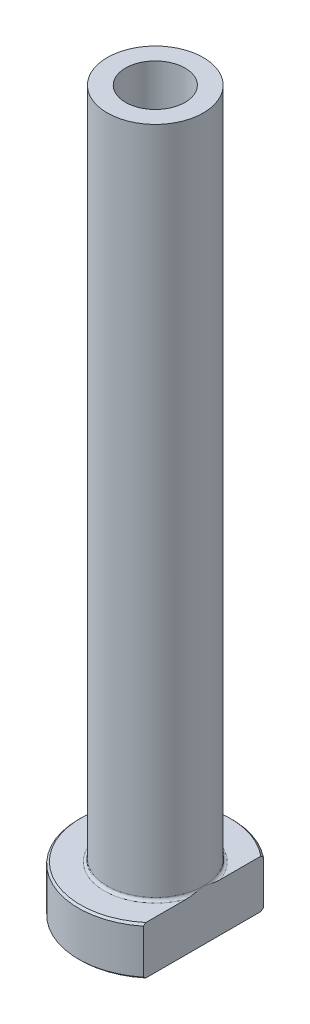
from build123d import *

# Parameters (mm, degrees)
FILLET1_R          = 0.3
CHAMFER1_SIZE      = 0.2
CUT_EXTRUDE1_DEPTH = 76.848533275
CHAMFER2_SIZE      = 0.5


with BuildPart() as part:
    # Sketch1 → Revolve1 (revolve)
    with BuildSketch(Plane.XY, mode=Mode.PRIVATE) as revolve1_sk:
        Polygon((-3.1, 75), (-5, 75), (-5, 5), (-8, 5), (-8, 0), (-3.35, 0), (-3.35, 18), (-3.1, 30), align=None)
    revolve(revolve1_sk.sketch.rotate(Axis((0, 92.187680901, 0), (0, -1, 0)), 270), axis=Axis((0, 92.187680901, 0), (0, -1, 0)))

    # Fillet1
    fillet1_edges = [part.edges().sort_by_distance(p)[0] for p in [
        (0, 5, -5),
    ]]
    fillet(fillet1_edges, radius=FILLET1_R)

    # Chamfer1
    chamfer1_edges = [part.edges().sort_by_distance(p)[0] for p in [
        (0, 0, -8),
        (0, 5, -8),
    ]]
    chamfer(chamfer1_edges, length=CHAMFER1_SIZE)

    # Sketch2 → Cut-Extrude1 (cut, through all)
    with BuildSketch(Plane.XZ):
        with BuildLine():
            Line((5, 6.244997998), (5, -6.244997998))
            ThreePointArc((5, -6.244997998), (8, 0), (5, 6.244997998))
        make_face()
    extrude(amount=-CUT_EXTRUDE1_DEPTH, mode=Mode.SUBTRACT)

    # Chamfer2
    chamfer2_edges = [part.edges().sort_by_distance(p)[0] for p in [
        (0, 0, -3.35),
    ]]
    chamfer(chamfer2_edges, length=CHAMFER2_SIZE)


solid = part.part
